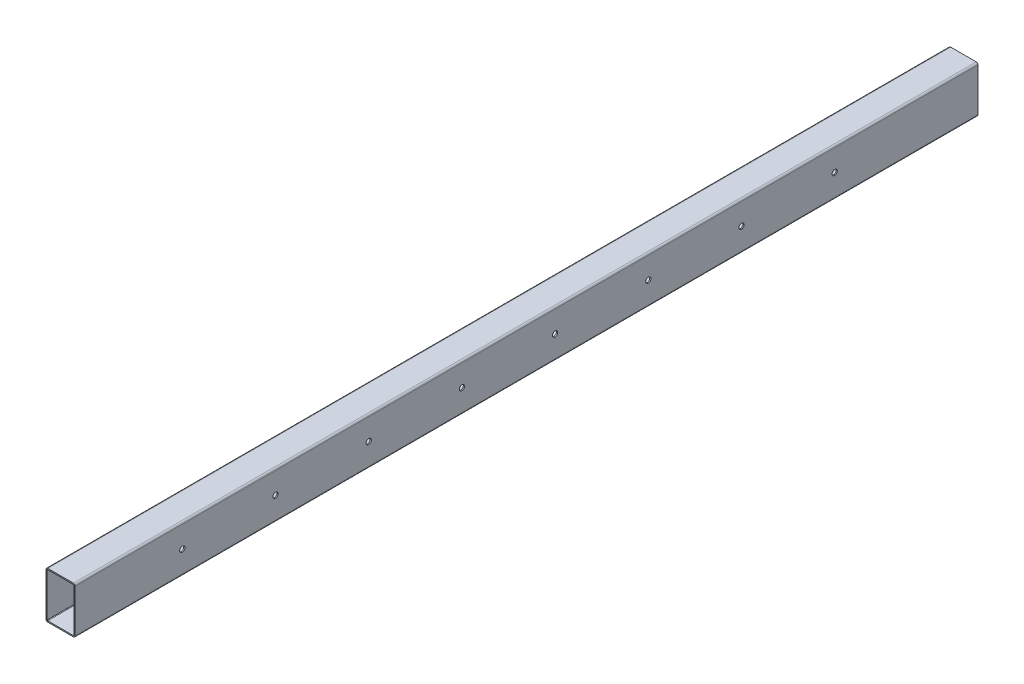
ISO-10303-21;
HEADER;
FILE_DESCRIPTION(('STEP AP214'),'2;1');
FILE_NAME('part.step','',(''),(''),'','','');
FILE_SCHEMA(('AUTOMOTIVE_DESIGN { 1 0 10303 214 1 1 1 1 }'));
ENDSEC;
DATA;
#1=APPLICATION_CONTEXT('core data for automotive mechanical design processes');
#2=APPLICATION_PROTOCOL_DEFINITION('international standard','automotive_design',2000,#1);
#3=PRODUCT_CONTEXT('',#1,'mechanical');
#4=PRODUCT('Part','Part','',(#3));
#5=PRODUCT_RELATED_PRODUCT_CATEGORY('part','',(#4));
#6=PRODUCT_DEFINITION_FORMATION('','',#4);
#7=PRODUCT_DEFINITION_CONTEXT('part definition',#1,'design');
#8=PRODUCT_DEFINITION('design','',#6,#7);
#9=PRODUCT_DEFINITION_SHAPE('','',#8);
#10=(LENGTH_UNIT() NAMED_UNIT(*) SI_UNIT(.MILLI.,.METRE.));
#11=(NAMED_UNIT(*) PLANE_ANGLE_UNIT() SI_UNIT($,.RADIAN.));
#12=(NAMED_UNIT(*) SI_UNIT($,.STERADIAN.) SOLID_ANGLE_UNIT());
#13=UNCERTAINTY_MEASURE_WITH_UNIT(LENGTH_MEASURE(1.E-05),#10,'distance_accuracy_value','');
#14=(GEOMETRIC_REPRESENTATION_CONTEXT(3) GLOBAL_UNCERTAINTY_ASSIGNED_CONTEXT((#13)) GLOBAL_UNIT_ASSIGNED_CONTEXT((#10,
#11,#12)) REPRESENTATION_CONTEXT('',''));
#15=CARTESIAN_POINT('',(0.,0.,0.));
#16=DIRECTION('',(0.,0.,1.));
#17=DIRECTION('',(1.,0.,0.));
#18=AXIS2_PLACEMENT_3D('',#15,#16,#17);
#19=CARTESIAN_POINT('',(3.,77.,-775.));
#20=DIRECTION('',(0.,0.,1.));
#21=DIRECTION('',(1.,0.,0.));
#22=AXIS2_PLACEMENT_3D('',#19,#20,#21);
#23=CYLINDRICAL_SURFACE('',#22,3.00000000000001);
#24=CARTESIAN_POINT('',(3.,77.,775.));
#25=DIRECTION('',(0.,0.,1.));
#26=DIRECTION('',(1.,0.,0.));
#27=AXIS2_PLACEMENT_3D('',#24,#25,#26);
#28=CIRCLE('',#27,3.00000000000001);
#29=CARTESIAN_POINT('',(3.,80.0000000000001,775.));
#30=VERTEX_POINT('',#29);
#31=CARTESIAN_POINT('',(0.,77.,775.));
#32=VERTEX_POINT('',#31);
#33=EDGE_CURVE('E521',#30,#32,#28,.T.);
#34=ORIENTED_EDGE('',*,*,#33,.F.);
#35=DIRECTION('',(0.,0.,1.));
#36=VECTOR('',#35,1.);
#37=CARTESIAN_POINT('',(3.,80.0000000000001,-775.));
#38=LINE('',#37,#36);
#39=CARTESIAN_POINT('',(3.,80.0000000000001,-775.));
#40=VERTEX_POINT('',#39);
#41=EDGE_CURVE('E580',#40,#30,#38,.T.);
#42=ORIENTED_EDGE('',*,*,#41,.F.);
#43=CARTESIAN_POINT('',(3.,77.,-775.));
#44=DIRECTION('',(0.,0.,1.));
#45=DIRECTION('',(1.,0.,0.));
#46=AXIS2_PLACEMENT_3D('',#43,#44,#45);
#47=CIRCLE('',#46,3.00000000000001);
#48=CARTESIAN_POINT('',(0.,77.,-775.));
#49=VERTEX_POINT('',#48);
#50=EDGE_CURVE('E555',#40,#49,#47,.T.);
#51=ORIENTED_EDGE('',*,*,#50,.T.);
#52=DIRECTION('',(0.,0.,1.));
#53=VECTOR('',#52,1.);
#54=CARTESIAN_POINT('',(0.,77.,-775.));
#55=LINE('',#54,#53);
#56=EDGE_CURVE('E579',#49,#32,#55,.T.);
#57=ORIENTED_EDGE('',*,*,#56,.T.);
#58=EDGE_LOOP('',(#34,#42,#51,#57));
#59=FACE_BOUND('',#58,.T.);
#60=ADVANCED_FACE('F348',(#59),#23,.T.);
#61=CARTESIAN_POINT('',(3.,80.0000000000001,-775.));
#62=DIRECTION('',(0.,1.,0.));
#63=DIRECTION('',(-1.,0.,0.));
#64=AXIS2_PLACEMENT_3D('',#61,#62,#63);
#65=PLANE('',#64);
#66=DIRECTION('',(-1.,0.,0.));
#67=VECTOR('',#66,1.);
#68=CARTESIAN_POINT('',(3.,80.0000000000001,775.));
#69=LINE('',#68,#67);
#70=CARTESIAN_POINT('',(47.,80.0000000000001,775.));
#71=VERTEX_POINT('',#70);
#72=EDGE_CURVE('E552',#71,#30,#69,.T.);
#73=ORIENTED_EDGE('',*,*,#72,.F.);
#74=DIRECTION('',(0.,0.,1.));
#75=VECTOR('',#74,1.);
#76=CARTESIAN_POINT('',(47.,80.0000000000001,-775.));
#77=LINE('',#76,#75);
#78=CARTESIAN_POINT('',(47.,80.0000000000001,-775.));
#79=VERTEX_POINT('',#78);
#80=EDGE_CURVE('E583',#79,#71,#77,.T.);
#81=ORIENTED_EDGE('',*,*,#80,.F.);
#82=DIRECTION('',(-1.,0.,0.));
#83=VECTOR('',#82,1.);
#84=CARTESIAN_POINT('',(3.,80.0000000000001,-775.));
#85=LINE('',#84,#83);
#86=EDGE_CURVE('E576',#79,#40,#85,.T.);
#87=ORIENTED_EDGE('',*,*,#86,.T.);
#88=ORIENTED_EDGE('',*,*,#41,.T.);
#89=EDGE_LOOP('',(#73,#81,#87,#88));
#90=FACE_BOUND('',#89,.T.);
#91=ADVANCED_FACE('F692',(#90),#65,.T.);
#92=CARTESIAN_POINT('',(47.,77.,-775.));
#93=DIRECTION('',(0.,0.,1.));
#94=DIRECTION('',(1.,0.,0.));
#95=AXIS2_PLACEMENT_3D('',#92,#93,#94);
#96=CYLINDRICAL_SURFACE('',#95,3.);
#97=CARTESIAN_POINT('',(47.,77.,775.));
#98=DIRECTION('',(0.,0.,1.));
#99=DIRECTION('',(1.,0.,0.));
#100=AXIS2_PLACEMENT_3D('',#97,#98,#99);
#101=CIRCLE('',#100,3.);
#102=CARTESIAN_POINT('',(50.,77.,775.));
#103=VERTEX_POINT('',#102);
#104=EDGE_CURVE('E549',#103,#71,#101,.T.);
#105=ORIENTED_EDGE('',*,*,#104,.F.);
#106=DIRECTION('',(0.,0.,1.));
#107=VECTOR('',#106,1.);
#108=CARTESIAN_POINT('',(50.,77.,-775.));
#109=LINE('',#108,#107);
#110=CARTESIAN_POINT('',(50.,77.,-775.));
#111=VERTEX_POINT('',#110);
#112=EDGE_CURVE('E585',#111,#103,#109,.T.);
#113=ORIENTED_EDGE('',*,*,#112,.F.);
#114=CARTESIAN_POINT('',(47.,77.,-775.));
#115=DIRECTION('',(0.,0.,1.));
#116=DIRECTION('',(1.,0.,0.));
#117=AXIS2_PLACEMENT_3D('',#114,#115,#116);
#118=CIRCLE('',#117,3.);
#119=EDGE_CURVE('E573',#111,#79,#118,.T.);
#120=ORIENTED_EDGE('',*,*,#119,.T.);
#121=ORIENTED_EDGE('',*,*,#80,.T.);
#122=EDGE_LOOP('',(#105,#113,#120,#121));
#123=FACE_BOUND('',#122,.T.);
#124=ADVANCED_FACE('F698',(#123),#96,.T.);
#125=CARTESIAN_POINT('',(50.,2.99999999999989,-775.));
#126=DIRECTION('',(1.,0.,0.));
#127=DIRECTION('',(0.,1.,0.));
#128=AXIS2_PLACEMENT_3D('',#125,#126,#127);
#129=PLANE('',#128);
#130=CARTESIAN_POINT('',(50.,40.,431.));
#131=DIRECTION('',(1.,0.,0.));
#132=DIRECTION('',(0.,1.,0.));
#133=AXIS2_PLACEMENT_3D('',#130,#131,#132);
#134=CIRCLE('',#133,4.50000000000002);
#135=CARTESIAN_POINT('',(50.,44.5000000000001,431.));
#136=VERTEX_POINT('',#135);
#137=EDGE_CURVE('E875',#136,#136,#134,.T.);
#138=ORIENTED_EDGE('',*,*,#137,.F.);
#139=EDGE_LOOP('',(#138));
#140=FACE_BOUND('',#139,.T.);
#141=CARTESIAN_POINT('',(50.,40.,591.));
#142=DIRECTION('',(1.,0.,0.));
#143=DIRECTION('',(0.,1.,0.));
#144=AXIS2_PLACEMENT_3D('',#141,#142,#143);
#145=CIRCLE('',#144,4.50000000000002);
#146=CARTESIAN_POINT('',(50.,44.5000000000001,591.));
#147=VERTEX_POINT('',#146);
#148=EDGE_CURVE('E869',#147,#147,#145,.T.);
#149=ORIENTED_EDGE('',*,*,#148,.F.);
#150=EDGE_LOOP('',(#149));
#151=FACE_BOUND('',#150,.T.);
#152=DIRECTION('',(0.,1.,0.));
#153=VECTOR('',#152,1.);
#154=CARTESIAN_POINT('',(50.,2.99999999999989,775.));
#155=LINE('',#154,#153);
#156=CARTESIAN_POINT('',(50.,2.99999999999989,775.));
#157=VERTEX_POINT('',#156);
#158=EDGE_CURVE('E546',#157,#103,#155,.T.);
#159=ORIENTED_EDGE('',*,*,#158,.F.);
#160=DIRECTION('',(0.,0.,1.));
#161=VECTOR('',#160,1.);
#162=CARTESIAN_POINT('',(50.,2.99999999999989,-775.));
#163=LINE('',#162,#161);
#164=CARTESIAN_POINT('',(50.,2.99999999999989,-775.));
#165=VERTEX_POINT('',#164);
#166=EDGE_CURVE('E587',#165,#157,#163,.T.);
#167=ORIENTED_EDGE('',*,*,#166,.F.);
#168=DIRECTION('',(0.,1.,0.));
#169=VECTOR('',#168,1.);
#170=CARTESIAN_POINT('',(50.,2.99999999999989,-775.));
#171=LINE('',#170,#169);
#172=EDGE_CURVE('E570',#165,#111,#171,.T.);
#173=ORIENTED_EDGE('',*,*,#172,.T.);
#174=ORIENTED_EDGE('',*,*,#112,.T.);
#175=EDGE_LOOP('',(#159,#167,#173,#174));
#176=FACE_BOUND('',#175,.T.);
#177=CARTESIAN_POINT('',(50.,40.,271.));
#178=DIRECTION('',(1.,0.,0.));
#179=DIRECTION('',(0.,1.,0.));
#180=AXIS2_PLACEMENT_3D('',#177,#178,#179);
#181=CIRCLE('',#180,4.50000000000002);
#182=CARTESIAN_POINT('',(50.,44.5000000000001,271.));
#183=VERTEX_POINT('',#182);
#184=EDGE_CURVE('E582',#183,#183,#181,.T.);
#185=ORIENTED_EDGE('',*,*,#184,.F.);
#186=EDGE_LOOP('',(#185));
#187=FACE_BOUND('',#186,.T.);
#188=CARTESIAN_POINT('',(50.,40.,111.));
#189=DIRECTION('',(1.,0.,0.));
#190=DIRECTION('',(0.,1.,0.));
#191=AXIS2_PLACEMENT_3D('',#188,#189,#190);
#192=CIRCLE('',#191,4.50000000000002);
#193=CARTESIAN_POINT('',(50.,44.5000000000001,111.));
#194=VERTEX_POINT('',#193);
#195=EDGE_CURVE('E606',#194,#194,#192,.T.);
#196=ORIENTED_EDGE('',*,*,#195,.F.);
#197=EDGE_LOOP('',(#196));
#198=FACE_BOUND('',#197,.T.);
#199=CARTESIAN_POINT('',(50.,40.,-49.));
#200=DIRECTION('',(1.,0.,0.));
#201=DIRECTION('',(0.,1.,0.));
#202=AXIS2_PLACEMENT_3D('',#199,#200,#201);
#203=CIRCLE('',#202,4.50000000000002);
#204=CARTESIAN_POINT('',(50.,44.5000000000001,-49.));
#205=VERTEX_POINT('',#204);
#206=EDGE_CURVE('E612',#205,#205,#203,.T.);
#207=ORIENTED_EDGE('',*,*,#206,.F.);
#208=EDGE_LOOP('',(#207));
#209=FACE_BOUND('',#208,.T.);
#210=CARTESIAN_POINT('',(50.,40.,-209.));
#211=DIRECTION('',(1.,0.,0.));
#212=DIRECTION('',(0.,1.,0.));
#213=AXIS2_PLACEMENT_3D('',#210,#211,#212);
#214=CIRCLE('',#213,4.50000000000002);
#215=CARTESIAN_POINT('',(50.,44.5000000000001,-209.));
#216=VERTEX_POINT('',#215);
#217=EDGE_CURVE('E618',#216,#216,#214,.T.);
#218=ORIENTED_EDGE('',*,*,#217,.F.);
#219=EDGE_LOOP('',(#218));
#220=FACE_BOUND('',#219,.T.);
#221=CARTESIAN_POINT('',(50.,40.,-369.));
#222=DIRECTION('',(1.,0.,0.));
#223=DIRECTION('',(0.,1.,0.));
#224=AXIS2_PLACEMENT_3D('',#221,#222,#223);
#225=CIRCLE('',#224,4.50000000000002);
#226=CARTESIAN_POINT('',(50.,44.5000000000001,-369.));
#227=VERTEX_POINT('',#226);
#228=EDGE_CURVE('E624',#227,#227,#225,.T.);
#229=ORIENTED_EDGE('',*,*,#228,.F.);
#230=EDGE_LOOP('',(#229));
#231=FACE_BOUND('',#230,.T.);
#232=CARTESIAN_POINT('',(50.,40.,-529.));
#233=DIRECTION('',(1.,0.,0.));
#234=DIRECTION('',(0.,1.,0.));
#235=AXIS2_PLACEMENT_3D('',#232,#233,#234);
#236=CIRCLE('',#235,4.50000000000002);
#237=CARTESIAN_POINT('',(50.,44.5000000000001,-529.));
#238=VERTEX_POINT('',#237);
#239=EDGE_CURVE('E630',#238,#238,#236,.T.);
#240=ORIENTED_EDGE('',*,*,#239,.F.);
#241=EDGE_LOOP('',(#240));
#242=FACE_BOUND('',#241,.T.);
#243=ADVANCED_FACE('F808',(#140,#151,#176,#187,#198,#209,#220,#231,#242),#129,.T.);
#244=CARTESIAN_POINT('',(47.,2.99999999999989,-775.));
#245=DIRECTION('',(0.,0.,1.));
#246=DIRECTION('',(1.,0.,0.));
#247=AXIS2_PLACEMENT_3D('',#244,#245,#246);
#248=CYLINDRICAL_SURFACE('',#247,3.);
#249=CARTESIAN_POINT('',(47.,2.99999999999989,775.));
#250=DIRECTION('',(0.,0.,1.));
#251=DIRECTION('',(-1.,0.,0.));
#252=AXIS2_PLACEMENT_3D('',#249,#250,#251);
#253=CIRCLE('',#252,3.);
#254=CARTESIAN_POINT('',(47.,0.,775.));
#255=VERTEX_POINT('',#254);
#256=EDGE_CURVE('E543',#255,#157,#253,.T.);
#257=ORIENTED_EDGE('',*,*,#256,.F.);
#258=DIRECTION('',(0.,0.,1.));
#259=VECTOR('',#258,1.);
#260=CARTESIAN_POINT('',(47.,0.,-775.));
#261=LINE('',#260,#259);
#262=CARTESIAN_POINT('',(47.,0.,-775.));
#263=VERTEX_POINT('',#262);
#264=EDGE_CURVE('E589',#263,#255,#261,.T.);
#265=ORIENTED_EDGE('',*,*,#264,.F.);
#266=CARTESIAN_POINT('',(47.,2.99999999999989,-775.));
#267=DIRECTION('',(0.,0.,1.));
#268=DIRECTION('',(-1.,0.,0.));
#269=AXIS2_PLACEMENT_3D('',#266,#267,#268);
#270=CIRCLE('',#269,3.);
#271=EDGE_CURVE('E567',#263,#165,#270,.T.);
#272=ORIENTED_EDGE('',*,*,#271,.T.);
#273=ORIENTED_EDGE('',*,*,#166,.T.);
#274=EDGE_LOOP('',(#257,#265,#272,#273));
#275=FACE_BOUND('',#274,.T.);
#276=ADVANCED_FACE('F812',(#275),#248,.T.);
#277=CARTESIAN_POINT('',(3.00000000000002,0.,-775.));
#278=DIRECTION('',(0.,-1.,0.));
#279=DIRECTION('',(0.,0.,-1.));
#280=AXIS2_PLACEMENT_3D('',#277,#278,#279);
#281=PLANE('',#280);
#282=DIRECTION('',(1.,0.,0.));
#283=VECTOR('',#282,1.);
#284=CARTESIAN_POINT('',(3.00000000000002,0.,775.));
#285=LINE('',#284,#283);
#286=CARTESIAN_POINT('',(3.00000000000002,0.,775.));
#287=VERTEX_POINT('',#286);
#288=EDGE_CURVE('E540',#287,#255,#285,.T.);
#289=ORIENTED_EDGE('',*,*,#288,.F.);
#290=DIRECTION('',(0.,0.,1.));
#291=VECTOR('',#290,1.);
#292=CARTESIAN_POINT('',(3.00000000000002,0.,-775.));
#293=LINE('',#292,#291);
#294=CARTESIAN_POINT('',(3.00000000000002,0.,-775.));
#295=VERTEX_POINT('',#294);
#296=EDGE_CURVE('E591',#295,#287,#293,.T.);
#297=ORIENTED_EDGE('',*,*,#296,.F.);
#298=DIRECTION('',(1.,0.,0.));
#299=VECTOR('',#298,1.);
#300=CARTESIAN_POINT('',(3.00000000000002,0.,-775.));
#301=LINE('',#300,#299);
#302=EDGE_CURVE('E564',#295,#263,#301,.T.);
#303=ORIENTED_EDGE('',*,*,#302,.T.);
#304=ORIENTED_EDGE('',*,*,#264,.T.);
#305=EDGE_LOOP('',(#289,#297,#303,#304));
#306=FACE_BOUND('',#305,.T.);
#307=ADVANCED_FACE('F765',(#306),#281,.T.);
#308=CARTESIAN_POINT('',(3.,2.99999999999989,-775.));
#309=DIRECTION('',(0.,0.,1.));
#310=DIRECTION('',(1.,0.,0.));
#311=AXIS2_PLACEMENT_3D('',#308,#309,#310);
#312=CYLINDRICAL_SURFACE('',#311,3.);
#313=CARTESIAN_POINT('',(3.,2.99999999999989,775.));
#314=DIRECTION('',(0.,0.,1.));
#315=DIRECTION('',(1.,0.,0.));
#316=AXIS2_PLACEMENT_3D('',#313,#314,#315);
#317=CIRCLE('',#316,3.);
#318=CARTESIAN_POINT('',(0.,3.00000000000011,775.));
#319=VERTEX_POINT('',#318);
#320=EDGE_CURVE('E537',#319,#287,#317,.T.);
#321=ORIENTED_EDGE('',*,*,#320,.F.);
#322=DIRECTION('',(0.,0.,1.));
#323=VECTOR('',#322,1.);
#324=CARTESIAN_POINT('',(0.,3.00000000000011,-775.));
#325=LINE('',#324,#323);
#326=CARTESIAN_POINT('',(0.,3.00000000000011,-775.));
#327=VERTEX_POINT('',#326);
#328=EDGE_CURVE('E593',#327,#319,#325,.T.);
#329=ORIENTED_EDGE('',*,*,#328,.F.);
#330=CARTESIAN_POINT('',(3.,2.99999999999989,-775.));
#331=DIRECTION('',(0.,0.,1.));
#332=DIRECTION('',(1.,0.,0.));
#333=AXIS2_PLACEMENT_3D('',#330,#331,#332);
#334=CIRCLE('',#333,3.);
#335=EDGE_CURVE('E561',#327,#295,#334,.T.);
#336=ORIENTED_EDGE('',*,*,#335,.T.);
#337=ORIENTED_EDGE('',*,*,#296,.T.);
#338=EDGE_LOOP('',(#321,#329,#336,#337));
#339=FACE_BOUND('',#338,.T.);
#340=ADVANCED_FACE('F757',(#339),#312,.T.);
#341=CARTESIAN_POINT('',(0.,3.00000000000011,-775.));
#342=DIRECTION('',(-1.,0.,0.));
#343=DIRECTION('',(0.,-1.,0.));
#344=AXIS2_PLACEMENT_3D('',#341,#342,#343);
#345=PLANE('',#344);
#346=CARTESIAN_POINT('',(0.,40.,431.));
#347=DIRECTION('',(1.,0.,0.));
#348=DIRECTION('',(0.,1.,0.));
#349=AXIS2_PLACEMENT_3D('',#346,#347,#348);
#350=CIRCLE('',#349,4.50000000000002);
#351=CARTESIAN_POINT('',(0.,44.5000000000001,431.));
#352=VERTEX_POINT('',#351);
#353=EDGE_CURVE('E770',#352,#352,#350,.T.);
#354=ORIENTED_EDGE('',*,*,#353,.T.);
#355=EDGE_LOOP('',(#354));
#356=FACE_BOUND('',#355,.T.);
#357=CARTESIAN_POINT('',(0.,40.,591.));
#358=DIRECTION('',(1.,0.,0.));
#359=DIRECTION('',(0.,1.,0.));
#360=AXIS2_PLACEMENT_3D('',#357,#358,#359);
#361=CIRCLE('',#360,4.50000000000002);
#362=CARTESIAN_POINT('',(0.,44.5000000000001,591.));
#363=VERTEX_POINT('',#362);
#364=EDGE_CURVE('E600',#363,#363,#361,.T.);
#365=ORIENTED_EDGE('',*,*,#364,.T.);
#366=EDGE_LOOP('',(#365));
#367=FACE_BOUND('',#366,.T.);
#368=DIRECTION('',(0.,-1.,0.));
#369=VECTOR('',#368,1.);
#370=CARTESIAN_POINT('',(0.,3.00000000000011,775.));
#371=LINE('',#370,#369);
#372=EDGE_CURVE('E534',#32,#319,#371,.T.);
#373=ORIENTED_EDGE('',*,*,#372,.F.);
#374=ORIENTED_EDGE('',*,*,#56,.F.);
#375=DIRECTION('',(0.,-1.,0.));
#376=VECTOR('',#375,1.);
#377=CARTESIAN_POINT('',(0.,3.00000000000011,-775.));
#378=LINE('',#377,#376);
#379=EDGE_CURVE('E558',#49,#327,#378,.T.);
#380=ORIENTED_EDGE('',*,*,#379,.T.);
#381=ORIENTED_EDGE('',*,*,#328,.T.);
#382=EDGE_LOOP('',(#373,#374,#380,#381));
#383=FACE_BOUND('',#382,.T.);
#384=CARTESIAN_POINT('',(0.,40.,271.));
#385=DIRECTION('',(1.,0.,0.));
#386=DIRECTION('',(0.,1.,0.));
#387=AXIS2_PLACEMENT_3D('',#384,#385,#386);
#388=CIRCLE('',#387,4.50000000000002);
#389=CARTESIAN_POINT('',(0.,44.5000000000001,271.));
#390=VERTEX_POINT('',#389);
#391=EDGE_CURVE('E636',#390,#390,#388,.T.);
#392=ORIENTED_EDGE('',*,*,#391,.T.);
#393=EDGE_LOOP('',(#392));
#394=FACE_BOUND('',#393,.T.);
#395=CARTESIAN_POINT('',(0.,40.,111.));
#396=DIRECTION('',(1.,0.,0.));
#397=DIRECTION('',(0.,1.,0.));
#398=AXIS2_PLACEMENT_3D('',#395,#396,#397);
#399=CIRCLE('',#398,4.50000000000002);
#400=CARTESIAN_POINT('',(0.,44.5000000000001,111.));
#401=VERTEX_POINT('',#400);
#402=EDGE_CURVE('E642',#401,#401,#399,.T.);
#403=ORIENTED_EDGE('',*,*,#402,.T.);
#404=EDGE_LOOP('',(#403));
#405=FACE_BOUND('',#404,.T.);
#406=CARTESIAN_POINT('',(0.,40.,-49.));
#407=DIRECTION('',(1.,0.,0.));
#408=DIRECTION('',(0.,1.,0.));
#409=AXIS2_PLACEMENT_3D('',#406,#407,#408);
#410=CIRCLE('',#409,4.50000000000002);
#411=CARTESIAN_POINT('',(0.,44.5000000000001,-49.));
#412=VERTEX_POINT('',#411);
#413=EDGE_CURVE('E648',#412,#412,#410,.T.);
#414=ORIENTED_EDGE('',*,*,#413,.T.);
#415=EDGE_LOOP('',(#414));
#416=FACE_BOUND('',#415,.T.);
#417=CARTESIAN_POINT('',(0.,40.,-209.));
#418=DIRECTION('',(1.,0.,0.));
#419=DIRECTION('',(0.,1.,0.));
#420=AXIS2_PLACEMENT_3D('',#417,#418,#419);
#421=CIRCLE('',#420,4.50000000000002);
#422=CARTESIAN_POINT('',(0.,44.5000000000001,-209.));
#423=VERTEX_POINT('',#422);
#424=EDGE_CURVE('E654',#423,#423,#421,.T.);
#425=ORIENTED_EDGE('',*,*,#424,.T.);
#426=EDGE_LOOP('',(#425));
#427=FACE_BOUND('',#426,.T.);
#428=CARTESIAN_POINT('',(0.,40.,-369.));
#429=DIRECTION('',(1.,0.,0.));
#430=DIRECTION('',(0.,1.,0.));
#431=AXIS2_PLACEMENT_3D('',#428,#429,#430);
#432=CIRCLE('',#431,4.50000000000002);
#433=CARTESIAN_POINT('',(0.,44.5000000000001,-369.));
#434=VERTEX_POINT('',#433);
#435=EDGE_CURVE('E660',#434,#434,#432,.T.);
#436=ORIENTED_EDGE('',*,*,#435,.T.);
#437=EDGE_LOOP('',(#436));
#438=FACE_BOUND('',#437,.T.);
#439=CARTESIAN_POINT('',(0.,40.,-529.));
#440=DIRECTION('',(1.,0.,0.));
#441=DIRECTION('',(0.,1.,0.));
#442=AXIS2_PLACEMENT_3D('',#439,#440,#441);
#443=CIRCLE('',#442,4.50000000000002);
#444=CARTESIAN_POINT('',(0.,44.5000000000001,-529.));
#445=VERTEX_POINT('',#444);
#446=EDGE_CURVE('E356',#445,#445,#443,.T.);
#447=ORIENTED_EDGE('',*,*,#446,.T.);
#448=EDGE_LOOP('',(#447));
#449=FACE_BOUND('',#448,.T.);
#450=ADVANCED_FACE('F668',(#356,#367,#383,#394,#405,#416,#427,#438,#449),#345,.T.);
#451=CARTESIAN_POINT('',(3.,77.,-775.));
#452=DIRECTION('',(0.,0.,1.));
#453=DIRECTION('',(1.,0.,0.));
#454=AXIS2_PLACEMENT_3D('',#451,#452,#453);
#455=PLANE('',#454);
#456=DIRECTION('',(-1.,0.,0.));
#457=VECTOR('',#456,1.);
#458=CARTESIAN_POINT('',(3.,78.0000000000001,-775.));
#459=LINE('',#458,#457);
#460=CARTESIAN_POINT('',(47.,78.0000000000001,-775.));
#461=VERTEX_POINT('',#460);
#462=CARTESIAN_POINT('',(3.,78.0000000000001,-775.));
#463=VERTEX_POINT('',#462);
#464=EDGE_CURVE('E516',#461,#463,#459,.T.);
#465=ORIENTED_EDGE('',*,*,#464,.T.);
#466=CARTESIAN_POINT('',(3.,77.,-775.));
#467=DIRECTION('',(0.,0.,1.));
#468=DIRECTION('',(-1.,0.,0.));
#469=AXIS2_PLACEMENT_3D('',#466,#467,#468);
#470=CIRCLE('',#469,0.999999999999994);
#471=CARTESIAN_POINT('',(2.,77.,-775.));
#472=VERTEX_POINT('',#471);
#473=EDGE_CURVE('E498',#463,#472,#470,.T.);
#474=ORIENTED_EDGE('',*,*,#473,.T.);
#475=DIRECTION('',(0.,-1.,0.));
#476=VECTOR('',#475,1.);
#477=CARTESIAN_POINT('',(2.,77.,-775.));
#478=LINE('',#477,#476);
#479=CARTESIAN_POINT('',(2.00000000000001,3.00000000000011,-775.));
#480=VERTEX_POINT('',#479);
#481=EDGE_CURVE('E501',#472,#480,#478,.T.);
#482=ORIENTED_EDGE('',*,*,#481,.T.);
#483=CARTESIAN_POINT('',(3.00000000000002,2.99999999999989,-775.));
#484=DIRECTION('',(0.,0.,1.));
#485=DIRECTION('',(-1.,0.,0.));
#486=AXIS2_PLACEMENT_3D('',#483,#484,#485);
#487=CIRCLE('',#486,1.);
#488=CARTESIAN_POINT('',(3.00000000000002,2.,-775.));
#489=VERTEX_POINT('',#488);
#490=EDGE_CURVE('E363',#480,#489,#487,.T.);
#491=ORIENTED_EDGE('',*,*,#490,.T.);
#492=DIRECTION('',(1.,0.,0.));
#493=VECTOR('',#492,1.);
#494=CARTESIAN_POINT('',(3.00000000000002,2.,-775.));
#495=LINE('',#494,#493);
#496=CARTESIAN_POINT('',(47.,2.,-775.));
#497=VERTEX_POINT('',#496);
#498=EDGE_CURVE('E504',#489,#497,#495,.T.);
#499=ORIENTED_EDGE('',*,*,#498,.T.);
#500=CARTESIAN_POINT('',(47.,2.99999999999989,-775.));
#501=DIRECTION('',(0.,0.,1.));
#502=DIRECTION('',(-1.,0.,0.));
#503=AXIS2_PLACEMENT_3D('',#500,#501,#502);
#504=CIRCLE('',#503,1.00000000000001);
#505=CARTESIAN_POINT('',(48.,3.00000000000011,-775.));
#506=VERTEX_POINT('',#505);
#507=EDGE_CURVE('E507',#497,#506,#504,.T.);
#508=ORIENTED_EDGE('',*,*,#507,.T.);
#509=DIRECTION('',(0.,1.,0.));
#510=VECTOR('',#509,1.);
#511=CARTESIAN_POINT('',(48.,77.,-775.));
#512=LINE('',#511,#510);
#513=CARTESIAN_POINT('',(48.,77.,-775.));
#514=VERTEX_POINT('',#513);
#515=EDGE_CURVE('E510',#506,#514,#512,.T.);
#516=ORIENTED_EDGE('',*,*,#515,.T.);
#517=CARTESIAN_POINT('',(47.,77.,-775.));
#518=DIRECTION('',(0.,0.,1.));
#519=DIRECTION('',(1.,0.,0.));
#520=AXIS2_PLACEMENT_3D('',#517,#518,#519);
#521=CIRCLE('',#520,1.00000000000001);
#522=EDGE_CURVE('E513',#514,#461,#521,.T.);
#523=ORIENTED_EDGE('',*,*,#522,.T.);
#524=EDGE_LOOP('',(#465,#474,#482,#491,#499,#508,#516,#523));
#525=FACE_BOUND('',#524,.T.);
#526=ORIENTED_EDGE('',*,*,#50,.F.);
#527=ORIENTED_EDGE('',*,*,#86,.F.);
#528=ORIENTED_EDGE('',*,*,#119,.F.);
#529=ORIENTED_EDGE('',*,*,#172,.F.);
#530=ORIENTED_EDGE('',*,*,#271,.F.);
#531=ORIENTED_EDGE('',*,*,#302,.F.);
#532=ORIENTED_EDGE('',*,*,#335,.F.);
#533=ORIENTED_EDGE('',*,*,#379,.F.);
#534=EDGE_LOOP('',(#526,#527,#528,#529,#530,#531,#532,#533));
#535=FACE_BOUND('',#534,.T.);
#536=ADVANCED_FACE('F756',(#525,#535),#455,.F.);
#537=CARTESIAN_POINT('',(3.,77.,775.));
#538=DIRECTION('',(0.,0.,1.));
#539=DIRECTION('',(1.,0.,0.));
#540=AXIS2_PLACEMENT_3D('',#537,#538,#539);
#541=PLANE('',#540);
#542=CARTESIAN_POINT('',(3.,77.,775.));
#543=DIRECTION('',(0.,0.,1.));
#544=DIRECTION('',(-1.,0.,0.));
#545=AXIS2_PLACEMENT_3D('',#542,#543,#544);
#546=CIRCLE('',#545,0.999999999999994);
#547=CARTESIAN_POINT('',(3.,78.0000000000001,775.));
#548=VERTEX_POINT('',#547);
#549=CARTESIAN_POINT('',(2.,77.,775.));
#550=VERTEX_POINT('',#549);
#551=EDGE_CURVE('E371',#548,#550,#546,.T.);
#552=ORIENTED_EDGE('',*,*,#551,.F.);
#553=DIRECTION('',(-1.,0.,0.));
#554=VECTOR('',#553,1.);
#555=CARTESIAN_POINT('',(3.,78.0000000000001,775.));
#556=LINE('',#555,#554);
#557=CARTESIAN_POINT('',(47.,78.0000000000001,775.));
#558=VERTEX_POINT('',#557);
#559=EDGE_CURVE('E495',#558,#548,#556,.T.);
#560=ORIENTED_EDGE('',*,*,#559,.F.);
#561=CARTESIAN_POINT('',(47.,77.,775.));
#562=DIRECTION('',(0.,0.,1.));
#563=DIRECTION('',(1.,0.,0.));
#564=AXIS2_PLACEMENT_3D('',#561,#562,#563);
#565=CIRCLE('',#564,1.00000000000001);
#566=CARTESIAN_POINT('',(48.,77.,775.));
#567=VERTEX_POINT('',#566);
#568=EDGE_CURVE('E492',#567,#558,#565,.T.);
#569=ORIENTED_EDGE('',*,*,#568,.F.);
#570=DIRECTION('',(0.,1.,0.));
#571=VECTOR('',#570,1.);
#572=CARTESIAN_POINT('',(48.,77.,775.));
#573=LINE('',#572,#571);
#574=CARTESIAN_POINT('',(48.,3.00000000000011,775.));
#575=VERTEX_POINT('',#574);
#576=EDGE_CURVE('E489',#575,#567,#573,.T.);
#577=ORIENTED_EDGE('',*,*,#576,.F.);
#578=CARTESIAN_POINT('',(47.,2.99999999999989,775.));
#579=DIRECTION('',(0.,0.,1.));
#580=DIRECTION('',(-1.,0.,0.));
#581=AXIS2_PLACEMENT_3D('',#578,#579,#580);
#582=CIRCLE('',#581,1.00000000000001);
#583=CARTESIAN_POINT('',(47.,2.,775.));
#584=VERTEX_POINT('',#583);
#585=EDGE_CURVE('E483',#584,#575,#582,.T.);
#586=ORIENTED_EDGE('',*,*,#585,.F.);
#587=DIRECTION('',(1.,0.,0.));
#588=VECTOR('',#587,1.);
#589=CARTESIAN_POINT('',(3.00000000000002,2.,775.));
#590=LINE('',#589,#588);
#591=CARTESIAN_POINT('',(3.00000000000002,2.,775.));
#592=VERTEX_POINT('',#591);
#593=EDGE_CURVE('E481',#592,#584,#590,.T.);
#594=ORIENTED_EDGE('',*,*,#593,.F.);
#595=CARTESIAN_POINT('',(3.00000000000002,2.99999999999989,775.));
#596=DIRECTION('',(0.,0.,1.));
#597=DIRECTION('',(-1.,0.,0.));
#598=AXIS2_PLACEMENT_3D('',#595,#596,#597);
#599=CIRCLE('',#598,1.);
#600=CARTESIAN_POINT('',(2.00000000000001,2.99999999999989,775.));
#601=VERTEX_POINT('',#600);
#602=EDGE_CURVE('E463',#601,#592,#599,.T.);
#603=ORIENTED_EDGE('',*,*,#602,.F.);
#604=DIRECTION('',(0.,-1.,0.));
#605=VECTOR('',#604,1.);
#606=CARTESIAN_POINT('',(2.,77.,775.));
#607=LINE('',#606,#605);
#608=EDGE_CURVE('E472',#550,#601,#607,.T.);
#609=ORIENTED_EDGE('',*,*,#608,.F.);
#610=EDGE_LOOP('',(#552,#560,#569,#577,#586,#594,#603,#609));
#611=FACE_BOUND('',#610,.T.);
#612=ORIENTED_EDGE('',*,*,#33,.T.);
#613=ORIENTED_EDGE('',*,*,#372,.T.);
#614=ORIENTED_EDGE('',*,*,#320,.T.);
#615=ORIENTED_EDGE('',*,*,#288,.T.);
#616=ORIENTED_EDGE('',*,*,#256,.T.);
#617=ORIENTED_EDGE('',*,*,#158,.T.);
#618=ORIENTED_EDGE('',*,*,#104,.T.);
#619=ORIENTED_EDGE('',*,*,#72,.T.);
#620=EDGE_LOOP('',(#612,#613,#614,#615,#616,#617,#618,#619));
#621=FACE_BOUND('',#620,.T.);
#622=ADVANCED_FACE('F477',(#611,#621),#541,.T.);
#623=CARTESIAN_POINT('',(3.,77.,-775.));
#624=DIRECTION('',(0.,0.,1.));
#625=DIRECTION('',(1.,0.,0.));
#626=AXIS2_PLACEMENT_3D('',#623,#624,#625);
#627=CYLINDRICAL_SURFACE('',#626,0.999999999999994);
#628=ORIENTED_EDGE('',*,*,#551,.T.);
#629=DIRECTION('',(0.,0.,1.));
#630=VECTOR('',#629,1.);
#631=CARTESIAN_POINT('',(2.,77.,-775.));
#632=LINE('',#631,#630);
#633=EDGE_CURVE('E469',#472,#550,#632,.T.);
#634=ORIENTED_EDGE('',*,*,#633,.F.);
#635=ORIENTED_EDGE('',*,*,#473,.F.);
#636=DIRECTION('',(0.,0.,1.));
#637=VECTOR('',#636,1.);
#638=CARTESIAN_POINT('',(3.,78.0000000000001,-775.));
#639=LINE('',#638,#637);
#640=EDGE_CURVE('E519',#463,#548,#639,.T.);
#641=ORIENTED_EDGE('',*,*,#640,.T.);
#642=EDGE_LOOP('',(#628,#634,#635,#641));
#643=FACE_BOUND('',#642,.T.);
#644=ADVANCED_FACE('F829',(#643),#627,.F.);
#645=CARTESIAN_POINT('',(3.,78.0000000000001,-775.));
#646=DIRECTION('',(0.,1.,0.));
#647=DIRECTION('',(-1.,0.,0.));
#648=AXIS2_PLACEMENT_3D('',#645,#646,#647);
#649=PLANE('',#648);
#650=ORIENTED_EDGE('',*,*,#559,.T.);
#651=ORIENTED_EDGE('',*,*,#640,.F.);
#652=ORIENTED_EDGE('',*,*,#464,.F.);
#653=DIRECTION('',(0.,0.,1.));
#654=VECTOR('',#653,1.);
#655=CARTESIAN_POINT('',(47.,78.0000000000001,-775.));
#656=LINE('',#655,#654);
#657=EDGE_CURVE('E522',#461,#558,#656,.T.);
#658=ORIENTED_EDGE('',*,*,#657,.T.);
#659=EDGE_LOOP('',(#650,#651,#652,#658));
#660=FACE_BOUND('',#659,.T.);
#661=ADVANCED_FACE('F831',(#660),#649,.F.);
#662=CARTESIAN_POINT('',(47.,77.,-775.));
#663=DIRECTION('',(0.,0.,1.));
#664=DIRECTION('',(1.,0.,0.));
#665=AXIS2_PLACEMENT_3D('',#662,#663,#664);
#666=CYLINDRICAL_SURFACE('',#665,1.00000000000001);
#667=ORIENTED_EDGE('',*,*,#568,.T.);
#668=ORIENTED_EDGE('',*,*,#657,.F.);
#669=ORIENTED_EDGE('',*,*,#522,.F.);
#670=DIRECTION('',(0.,0.,1.));
#671=VECTOR('',#670,1.);
#672=CARTESIAN_POINT('',(48.,77.,-775.));
#673=LINE('',#672,#671);
#674=EDGE_CURVE('E524',#514,#567,#673,.T.);
#675=ORIENTED_EDGE('',*,*,#674,.T.);
#676=EDGE_LOOP('',(#667,#668,#669,#675));
#677=FACE_BOUND('',#676,.T.);
#678=ADVANCED_FACE('F835',(#677),#666,.F.);
#679=CARTESIAN_POINT('',(48.,77.,-775.));
#680=DIRECTION('',(1.,0.,0.));
#681=DIRECTION('',(0.,1.,0.));
#682=AXIS2_PLACEMENT_3D('',#679,#680,#681);
#683=PLANE('',#682);
#684=CARTESIAN_POINT('',(48.,40.,431.));
#685=DIRECTION('',(1.,0.,0.));
#686=DIRECTION('',(0.,1.,0.));
#687=AXIS2_PLACEMENT_3D('',#684,#685,#686);
#688=CIRCLE('',#687,4.50000000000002);
#689=CARTESIAN_POINT('',(48.,44.5000000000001,431.));
#690=VERTEX_POINT('',#689);
#691=EDGE_CURVE('E872',#690,#690,#688,.T.);
#692=ORIENTED_EDGE('',*,*,#691,.T.);
#693=EDGE_LOOP('',(#692));
#694=FACE_BOUND('',#693,.T.);
#695=CARTESIAN_POINT('',(48.,40.,591.));
#696=DIRECTION('',(1.,0.,0.));
#697=DIRECTION('',(0.,1.,0.));
#698=AXIS2_PLACEMENT_3D('',#695,#696,#697);
#699=CIRCLE('',#698,4.50000000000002);
#700=CARTESIAN_POINT('',(48.,44.5000000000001,591.));
#701=VERTEX_POINT('',#700);
#702=EDGE_CURVE('E599',#701,#701,#699,.T.);
#703=ORIENTED_EDGE('',*,*,#702,.T.);
#704=EDGE_LOOP('',(#703));
#705=FACE_BOUND('',#704,.T.);
#706=ORIENTED_EDGE('',*,*,#576,.T.);
#707=ORIENTED_EDGE('',*,*,#674,.F.);
#708=ORIENTED_EDGE('',*,*,#515,.F.);
#709=DIRECTION('',(0.,0.,1.));
#710=VECTOR('',#709,1.);
#711=CARTESIAN_POINT('',(48.,3.00000000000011,-775.));
#712=LINE('',#711,#710);
#713=EDGE_CURVE('E526',#506,#575,#712,.T.);
#714=ORIENTED_EDGE('',*,*,#713,.T.);
#715=EDGE_LOOP('',(#706,#707,#708,#714));
#716=FACE_BOUND('',#715,.T.);
#717=CARTESIAN_POINT('',(48.,40.,271.));
#718=DIRECTION('',(1.,0.,0.));
#719=DIRECTION('',(0.,1.,0.));
#720=AXIS2_PLACEMENT_3D('',#717,#718,#719);
#721=CIRCLE('',#720,4.50000000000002);
#722=CARTESIAN_POINT('',(48.,44.5000000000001,271.));
#723=VERTEX_POINT('',#722);
#724=EDGE_CURVE('E603',#723,#723,#721,.T.);
#725=ORIENTED_EDGE('',*,*,#724,.T.);
#726=EDGE_LOOP('',(#725));
#727=FACE_BOUND('',#726,.T.);
#728=CARTESIAN_POINT('',(48.,40.,111.));
#729=DIRECTION('',(1.,0.,0.));
#730=DIRECTION('',(0.,1.,0.));
#731=AXIS2_PLACEMENT_3D('',#728,#729,#730);
#732=CIRCLE('',#731,4.50000000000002);
#733=CARTESIAN_POINT('',(48.,44.5000000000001,111.));
#734=VERTEX_POINT('',#733);
#735=EDGE_CURVE('E609',#734,#734,#732,.T.);
#736=ORIENTED_EDGE('',*,*,#735,.T.);
#737=EDGE_LOOP('',(#736));
#738=FACE_BOUND('',#737,.T.);
#739=CARTESIAN_POINT('',(48.,40.,-49.));
#740=DIRECTION('',(1.,0.,0.));
#741=DIRECTION('',(0.,1.,0.));
#742=AXIS2_PLACEMENT_3D('',#739,#740,#741);
#743=CIRCLE('',#742,4.50000000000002);
#744=CARTESIAN_POINT('',(48.,44.5000000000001,-49.));
#745=VERTEX_POINT('',#744);
#746=EDGE_CURVE('E615',#745,#745,#743,.T.);
#747=ORIENTED_EDGE('',*,*,#746,.T.);
#748=EDGE_LOOP('',(#747));
#749=FACE_BOUND('',#748,.T.);
#750=CARTESIAN_POINT('',(48.,40.,-209.));
#751=DIRECTION('',(1.,0.,0.));
#752=DIRECTION('',(0.,1.,0.));
#753=AXIS2_PLACEMENT_3D('',#750,#751,#752);
#754=CIRCLE('',#753,4.50000000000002);
#755=CARTESIAN_POINT('',(48.,44.5000000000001,-209.));
#756=VERTEX_POINT('',#755);
#757=EDGE_CURVE('E621',#756,#756,#754,.T.);
#758=ORIENTED_EDGE('',*,*,#757,.T.);
#759=EDGE_LOOP('',(#758));
#760=FACE_BOUND('',#759,.T.);
#761=CARTESIAN_POINT('',(48.,40.,-369.));
#762=DIRECTION('',(1.,0.,0.));
#763=DIRECTION('',(0.,1.,0.));
#764=AXIS2_PLACEMENT_3D('',#761,#762,#763);
#765=CIRCLE('',#764,4.50000000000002);
#766=CARTESIAN_POINT('',(48.,44.5000000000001,-369.));
#767=VERTEX_POINT('',#766);
#768=EDGE_CURVE('E627',#767,#767,#765,.T.);
#769=ORIENTED_EDGE('',*,*,#768,.T.);
#770=EDGE_LOOP('',(#769));
#771=FACE_BOUND('',#770,.T.);
#772=CARTESIAN_POINT('',(48.,40.,-529.));
#773=DIRECTION('',(1.,0.,0.));
#774=DIRECTION('',(0.,1.,0.));
#775=AXIS2_PLACEMENT_3D('',#772,#773,#774);
#776=CIRCLE('',#775,4.50000000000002);
#777=CARTESIAN_POINT('',(48.,44.5000000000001,-529.));
#778=VERTEX_POINT('',#777);
#779=EDGE_CURVE('E633',#778,#778,#776,.T.);
#780=ORIENTED_EDGE('',*,*,#779,.T.);
#781=EDGE_LOOP('',(#780));
#782=FACE_BOUND('',#781,.T.);
#783=ADVANCED_FACE('F841',(#694,#705,#716,#727,#738,#749,#760,#771,#782),#683,.F.);
#784=CARTESIAN_POINT('',(47.,2.99999999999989,-775.));
#785=DIRECTION('',(0.,0.,1.));
#786=DIRECTION('',(1.,0.,0.));
#787=AXIS2_PLACEMENT_3D('',#784,#785,#786);
#788=CYLINDRICAL_SURFACE('',#787,1.00000000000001);
#789=ORIENTED_EDGE('',*,*,#585,.T.);
#790=ORIENTED_EDGE('',*,*,#713,.F.);
#791=ORIENTED_EDGE('',*,*,#507,.F.);
#792=DIRECTION('',(0.,0.,1.));
#793=VECTOR('',#792,1.);
#794=CARTESIAN_POINT('',(47.,2.,-775.));
#795=LINE('',#794,#793);
#796=EDGE_CURVE('E528',#497,#584,#795,.T.);
#797=ORIENTED_EDGE('',*,*,#796,.T.);
#798=EDGE_LOOP('',(#789,#790,#791,#797));
#799=FACE_BOUND('',#798,.T.);
#800=ADVANCED_FACE('F848',(#799),#788,.F.);
#801=CARTESIAN_POINT('',(3.00000000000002,2.,-775.));
#802=DIRECTION('',(0.,-1.,0.));
#803=DIRECTION('',(0.,0.,-1.));
#804=AXIS2_PLACEMENT_3D('',#801,#802,#803);
#805=PLANE('',#804);
#806=ORIENTED_EDGE('',*,*,#593,.T.);
#807=ORIENTED_EDGE('',*,*,#796,.F.);
#808=ORIENTED_EDGE('',*,*,#498,.F.);
#809=DIRECTION('',(0.,0.,1.));
#810=VECTOR('',#809,1.);
#811=CARTESIAN_POINT('',(3.00000000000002,2.,-775.));
#812=LINE('',#811,#810);
#813=EDGE_CURVE('E468',#489,#592,#812,.T.);
#814=ORIENTED_EDGE('',*,*,#813,.T.);
#815=EDGE_LOOP('',(#806,#807,#808,#814));
#816=FACE_BOUND('',#815,.T.);
#817=ADVANCED_FACE('F686',(#816),#805,.F.);
#818=CARTESIAN_POINT('',(3.00000000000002,2.99999999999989,-775.));
#819=DIRECTION('',(0.,0.,1.));
#820=DIRECTION('',(1.,0.,0.));
#821=AXIS2_PLACEMENT_3D('',#818,#819,#820);
#822=CYLINDRICAL_SURFACE('',#821,1.);
#823=ORIENTED_EDGE('',*,*,#602,.T.);
#824=ORIENTED_EDGE('',*,*,#813,.F.);
#825=ORIENTED_EDGE('',*,*,#490,.F.);
#826=DIRECTION('',(0.,0.,1.));
#827=VECTOR('',#826,1.);
#828=CARTESIAN_POINT('',(2.00000000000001,2.99999999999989,-775.));
#829=LINE('',#828,#827);
#830=EDGE_CURVE('E459',#480,#601,#829,.T.);
#831=ORIENTED_EDGE('',*,*,#830,.T.);
#832=EDGE_LOOP('',(#823,#824,#825,#831));
#833=FACE_BOUND('',#832,.T.);
#834=ADVANCED_FACE('F461',(#833),#822,.F.);
#835=CARTESIAN_POINT('',(2.,77.,-775.));
#836=DIRECTION('',(-1.,0.,0.));
#837=DIRECTION('',(0.,-1.,0.));
#838=AXIS2_PLACEMENT_3D('',#835,#836,#837);
#839=PLANE('',#838);
#840=CARTESIAN_POINT('',(2.00000000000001,40.,431.));
#841=DIRECTION('',(-1.,0.,0.));
#842=DIRECTION('',(0.,-1.,0.));
#843=AXIS2_PLACEMENT_3D('',#840,#841,#842);
#844=CIRCLE('',#843,4.50000000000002);
#845=CARTESIAN_POINT('',(2.00000000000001,35.5,431.));
#846=VERTEX_POINT('',#845);
#847=EDGE_CURVE('E878',#846,#846,#844,.T.);
#848=ORIENTED_EDGE('',*,*,#847,.T.);
#849=EDGE_LOOP('',(#848));
#850=FACE_BOUND('',#849,.T.);
#851=CARTESIAN_POINT('',(2.00000000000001,40.,591.));
#852=DIRECTION('',(-1.,0.,0.));
#853=DIRECTION('',(0.,-1.,0.));
#854=AXIS2_PLACEMENT_3D('',#851,#852,#853);
#855=CIRCLE('',#854,4.50000000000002);
#856=CARTESIAN_POINT('',(2.00000000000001,35.5,591.));
#857=VERTEX_POINT('',#856);
#858=EDGE_CURVE('E596',#857,#857,#855,.T.);
#859=ORIENTED_EDGE('',*,*,#858,.T.);
#860=EDGE_LOOP('',(#859));
#861=FACE_BOUND('',#860,.T.);
#862=ORIENTED_EDGE('',*,*,#608,.T.);
#863=ORIENTED_EDGE('',*,*,#830,.F.);
#864=ORIENTED_EDGE('',*,*,#481,.F.);
#865=ORIENTED_EDGE('',*,*,#633,.T.);
#866=EDGE_LOOP('',(#862,#863,#864,#865));
#867=FACE_BOUND('',#866,.T.);
#868=CARTESIAN_POINT('',(2.00000000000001,40.,271.));
#869=DIRECTION('',(-1.,0.,0.));
#870=DIRECTION('',(0.,-1.,0.));
#871=AXIS2_PLACEMENT_3D('',#868,#869,#870);
#872=CIRCLE('',#871,4.50000000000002);
#873=CARTESIAN_POINT('',(2.00000000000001,35.5,271.));
#874=VERTEX_POINT('',#873);
#875=EDGE_CURVE('E639',#874,#874,#872,.T.);
#876=ORIENTED_EDGE('',*,*,#875,.T.);
#877=EDGE_LOOP('',(#876));
#878=FACE_BOUND('',#877,.T.);
#879=CARTESIAN_POINT('',(2.00000000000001,40.,111.));
#880=DIRECTION('',(-1.,0.,0.));
#881=DIRECTION('',(0.,-1.,0.));
#882=AXIS2_PLACEMENT_3D('',#879,#880,#881);
#883=CIRCLE('',#882,4.50000000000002);
#884=CARTESIAN_POINT('',(2.00000000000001,35.5,111.));
#885=VERTEX_POINT('',#884);
#886=EDGE_CURVE('E645',#885,#885,#883,.T.);
#887=ORIENTED_EDGE('',*,*,#886,.T.);
#888=EDGE_LOOP('',(#887));
#889=FACE_BOUND('',#888,.T.);
#890=CARTESIAN_POINT('',(2.00000000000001,40.,-49.));
#891=DIRECTION('',(-1.,0.,0.));
#892=DIRECTION('',(0.,-1.,0.));
#893=AXIS2_PLACEMENT_3D('',#890,#891,#892);
#894=CIRCLE('',#893,4.50000000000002);
#895=CARTESIAN_POINT('',(2.00000000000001,35.5,-49.));
#896=VERTEX_POINT('',#895);
#897=EDGE_CURVE('E651',#896,#896,#894,.T.);
#898=ORIENTED_EDGE('',*,*,#897,.T.);
#899=EDGE_LOOP('',(#898));
#900=FACE_BOUND('',#899,.T.);
#901=CARTESIAN_POINT('',(2.00000000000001,40.,-209.));
#902=DIRECTION('',(-1.,0.,0.));
#903=DIRECTION('',(0.,-1.,0.));
#904=AXIS2_PLACEMENT_3D('',#901,#902,#903);
#905=CIRCLE('',#904,4.50000000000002);
#906=CARTESIAN_POINT('',(2.00000000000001,35.5,-209.));
#907=VERTEX_POINT('',#906);
#908=EDGE_CURVE('E657',#907,#907,#905,.T.);
#909=ORIENTED_EDGE('',*,*,#908,.T.);
#910=EDGE_LOOP('',(#909));
#911=FACE_BOUND('',#910,.T.);
#912=CARTESIAN_POINT('',(2.00000000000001,40.,-369.));
#913=DIRECTION('',(-1.,0.,0.));
#914=DIRECTION('',(0.,-1.,0.));
#915=AXIS2_PLACEMENT_3D('',#912,#913,#914);
#916=CIRCLE('',#915,4.50000000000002);
#917=CARTESIAN_POINT('',(2.00000000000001,35.5,-369.));
#918=VERTEX_POINT('',#917);
#919=EDGE_CURVE('E663',#918,#918,#916,.T.);
#920=ORIENTED_EDGE('',*,*,#919,.T.);
#921=EDGE_LOOP('',(#920));
#922=FACE_BOUND('',#921,.T.);
#923=CARTESIAN_POINT('',(2.00000000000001,40.,-529.));
#924=DIRECTION('',(-1.,0.,0.));
#925=DIRECTION('',(0.,-1.,0.));
#926=AXIS2_PLACEMENT_3D('',#923,#924,#925);
#927=CIRCLE('',#926,4.50000000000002);
#928=CARTESIAN_POINT('',(2.00000000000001,35.5,-529.));
#929=VERTEX_POINT('',#928);
#930=EDGE_CURVE('E11',#929,#929,#927,.T.);
#931=ORIENTED_EDGE('',*,*,#930,.T.);
#932=EDGE_LOOP('',(#931));
#933=FACE_BOUND('',#932,.T.);
#934=ADVANCED_FACE('F473',(#850,#861,#867,#878,#889,#900,#911,#922,#933),#839,.F.);
#935=CARTESIAN_POINT('',(0.,40.,591.));
#936=DIRECTION('',(1.,0.,0.));
#937=DIRECTION('',(0.,1.,0.));
#938=AXIS2_PLACEMENT_3D('',#935,#936,#937);
#939=CYLINDRICAL_SURFACE('',#938,4.50000000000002);
#940=ORIENTED_EDGE('',*,*,#364,.F.);
#941=EDGE_LOOP('',(#940));
#942=FACE_BOUND('',#941,.T.);
#943=ORIENTED_EDGE('',*,*,#858,.F.);
#944=EDGE_LOOP('',(#943));
#945=FACE_BOUND('',#944,.T.);
#946=ADVANCED_FACE('F676',(#942,#945),#939,.F.);
#947=ORIENTED_EDGE('',*,*,#148,.T.);
#948=EDGE_LOOP('',(#947));
#949=FACE_BOUND('',#948,.T.);
#950=ORIENTED_EDGE('',*,*,#702,.F.);
#951=EDGE_LOOP('',(#950));
#952=FACE_BOUND('',#951,.T.);
#953=ADVANCED_FACE('F683',(#949,#952),#939,.F.);
#954=CARTESIAN_POINT('',(0.,40.,431.));
#955=DIRECTION('',(1.,0.,0.));
#956=DIRECTION('',(0.,1.,0.));
#957=AXIS2_PLACEMENT_3D('',#954,#955,#956);
#958=CYLINDRICAL_SURFACE('',#957,4.50000000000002);
#959=ORIENTED_EDGE('',*,*,#137,.T.);
#960=EDGE_LOOP('',(#959));
#961=FACE_BOUND('',#960,.T.);
#962=ORIENTED_EDGE('',*,*,#691,.F.);
#963=EDGE_LOOP('',(#962));
#964=FACE_BOUND('',#963,.T.);
#965=ADVANCED_FACE('F709',(#961,#964),#958,.F.);
#966=CARTESIAN_POINT('',(0.,40.,271.));
#967=DIRECTION('',(1.,0.,0.));
#968=DIRECTION('',(0.,1.,0.));
#969=AXIS2_PLACEMENT_3D('',#966,#967,#968);
#970=CYLINDRICAL_SURFACE('',#969,4.50000000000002);
#971=ORIENTED_EDGE('',*,*,#184,.T.);
#972=EDGE_LOOP('',(#971));
#973=FACE_BOUND('',#972,.T.);
#974=ORIENTED_EDGE('',*,*,#724,.F.);
#975=EDGE_LOOP('',(#974));
#976=FACE_BOUND('',#975,.T.);
#977=ADVANCED_FACE('F705',(#973,#976),#970,.F.);
#978=CARTESIAN_POINT('',(0.,40.,111.));
#979=DIRECTION('',(1.,0.,0.));
#980=DIRECTION('',(0.,1.,0.));
#981=AXIS2_PLACEMENT_3D('',#978,#979,#980);
#982=CYLINDRICAL_SURFACE('',#981,4.50000000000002);
#983=ORIENTED_EDGE('',*,*,#195,.T.);
#984=EDGE_LOOP('',(#983));
#985=FACE_BOUND('',#984,.T.);
#986=ORIENTED_EDGE('',*,*,#735,.F.);
#987=EDGE_LOOP('',(#986));
#988=FACE_BOUND('',#987,.T.);
#989=ADVANCED_FACE('F708',(#985,#988),#982,.F.);
#990=CARTESIAN_POINT('',(0.,40.,-49.));
#991=DIRECTION('',(1.,0.,0.));
#992=DIRECTION('',(0.,1.,0.));
#993=AXIS2_PLACEMENT_3D('',#990,#991,#992);
#994=CYLINDRICAL_SURFACE('',#993,4.50000000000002);
#995=ORIENTED_EDGE('',*,*,#206,.T.);
#996=EDGE_LOOP('',(#995));
#997=FACE_BOUND('',#996,.T.);
#998=ORIENTED_EDGE('',*,*,#746,.F.);
#999=EDGE_LOOP('',(#998));
#1000=FACE_BOUND('',#999,.T.);
#1001=ADVANCED_FACE('F713',(#997,#1000),#994,.F.);
#1002=CARTESIAN_POINT('',(0.,40.,-209.));
#1003=DIRECTION('',(1.,0.,0.));
#1004=DIRECTION('',(0.,1.,0.));
#1005=AXIS2_PLACEMENT_3D('',#1002,#1003,#1004);
#1006=CYLINDRICAL_SURFACE('',#1005,4.50000000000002);
#1007=ORIENTED_EDGE('',*,*,#217,.T.);
#1008=EDGE_LOOP('',(#1007));
#1009=FACE_BOUND('',#1008,.T.);
#1010=ORIENTED_EDGE('',*,*,#757,.F.);
#1011=EDGE_LOOP('',(#1010));
#1012=FACE_BOUND('',#1011,.T.);
#1013=ADVANCED_FACE('F717',(#1009,#1012),#1006,.F.);
#1014=CARTESIAN_POINT('',(0.,40.,-369.));
#1015=DIRECTION('',(1.,0.,0.));
#1016=DIRECTION('',(0.,1.,0.));
#1017=AXIS2_PLACEMENT_3D('',#1014,#1015,#1016);
#1018=CYLINDRICAL_SURFACE('',#1017,4.50000000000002);
#1019=ORIENTED_EDGE('',*,*,#228,.T.);
#1020=EDGE_LOOP('',(#1019));
#1021=FACE_BOUND('',#1020,.T.);
#1022=ORIENTED_EDGE('',*,*,#768,.F.);
#1023=EDGE_LOOP('',(#1022));
#1024=FACE_BOUND('',#1023,.T.);
#1025=ADVANCED_FACE('F721',(#1021,#1024),#1018,.F.);
#1026=CARTESIAN_POINT('',(0.,40.,-529.));
#1027=DIRECTION('',(1.,0.,0.));
#1028=DIRECTION('',(0.,1.,0.));
#1029=AXIS2_PLACEMENT_3D('',#1026,#1027,#1028);
#1030=CYLINDRICAL_SURFACE('',#1029,4.50000000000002);
#1031=ORIENTED_EDGE('',*,*,#239,.T.);
#1032=EDGE_LOOP('',(#1031));
#1033=FACE_BOUND('',#1032,.T.);
#1034=ORIENTED_EDGE('',*,*,#779,.F.);
#1035=EDGE_LOOP('',(#1034));
#1036=FACE_BOUND('',#1035,.T.);
#1037=ADVANCED_FACE('F725',(#1033,#1036),#1030,.F.);
#1038=CARTESIAN_POINT('',(0.,40.,431.));
#1039=DIRECTION('',(1.,0.,0.));
#1040=DIRECTION('',(0.,1.,0.));
#1041=AXIS2_PLACEMENT_3D('',#1038,#1039,#1040);
#1042=CYLINDRICAL_SURFACE('',#1041,4.50000000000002);
#1043=ORIENTED_EDGE('',*,*,#353,.F.);
#1044=EDGE_LOOP('',(#1043));
#1045=FACE_BOUND('',#1044,.T.);
#1046=ORIENTED_EDGE('',*,*,#847,.F.);
#1047=EDGE_LOOP('',(#1046));
#1048=FACE_BOUND('',#1047,.T.);
#1049=ADVANCED_FACE('F729',(#1045,#1048),#1042,.F.);
#1050=CARTESIAN_POINT('',(0.,40.,271.));
#1051=DIRECTION('',(1.,0.,0.));
#1052=DIRECTION('',(0.,1.,0.));
#1053=AXIS2_PLACEMENT_3D('',#1050,#1051,#1052);
#1054=CYLINDRICAL_SURFACE('',#1053,4.50000000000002);
#1055=ORIENTED_EDGE('',*,*,#391,.F.);
#1056=EDGE_LOOP('',(#1055));
#1057=FACE_BOUND('',#1056,.T.);
#1058=ORIENTED_EDGE('',*,*,#875,.F.);
#1059=EDGE_LOOP('',(#1058));
#1060=FACE_BOUND('',#1059,.T.);
#1061=ADVANCED_FACE('F731',(#1057,#1060),#1054,.F.);
#1062=CARTESIAN_POINT('',(0.,40.,111.));
#1063=DIRECTION('',(1.,0.,0.));
#1064=DIRECTION('',(0.,1.,0.));
#1065=AXIS2_PLACEMENT_3D('',#1062,#1063,#1064);
#1066=CYLINDRICAL_SURFACE('',#1065,4.50000000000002);
#1067=ORIENTED_EDGE('',*,*,#402,.F.);
#1068=EDGE_LOOP('',(#1067));
#1069=FACE_BOUND('',#1068,.T.);
#1070=ORIENTED_EDGE('',*,*,#886,.F.);
#1071=EDGE_LOOP('',(#1070));
#1072=FACE_BOUND('',#1071,.T.);
#1073=ADVANCED_FACE('F734',(#1069,#1072),#1066,.F.);
#1074=CARTESIAN_POINT('',(0.,40.,-49.));
#1075=DIRECTION('',(1.,0.,0.));
#1076=DIRECTION('',(0.,1.,0.));
#1077=AXIS2_PLACEMENT_3D('',#1074,#1075,#1076);
#1078=CYLINDRICAL_SURFACE('',#1077,4.50000000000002);
#1079=ORIENTED_EDGE('',*,*,#413,.F.);
#1080=EDGE_LOOP('',(#1079));
#1081=FACE_BOUND('',#1080,.T.);
#1082=ORIENTED_EDGE('',*,*,#897,.F.);
#1083=EDGE_LOOP('',(#1082));
#1084=FACE_BOUND('',#1083,.T.);
#1085=ADVANCED_FACE('F738',(#1081,#1084),#1078,.F.);
#1086=CARTESIAN_POINT('',(0.,40.,-209.));
#1087=DIRECTION('',(1.,0.,0.));
#1088=DIRECTION('',(0.,1.,0.));
#1089=AXIS2_PLACEMENT_3D('',#1086,#1087,#1088);
#1090=CYLINDRICAL_SURFACE('',#1089,4.50000000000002);
#1091=ORIENTED_EDGE('',*,*,#424,.F.);
#1092=EDGE_LOOP('',(#1091));
#1093=FACE_BOUND('',#1092,.T.);
#1094=ORIENTED_EDGE('',*,*,#908,.F.);
#1095=EDGE_LOOP('',(#1094));
#1096=FACE_BOUND('',#1095,.T.);
#1097=ADVANCED_FACE('F742',(#1093,#1096),#1090,.F.);
#1098=CARTESIAN_POINT('',(0.,40.,-369.));
#1099=DIRECTION('',(1.,0.,0.));
#1100=DIRECTION('',(0.,1.,0.));
#1101=AXIS2_PLACEMENT_3D('',#1098,#1099,#1100);
#1102=CYLINDRICAL_SURFACE('',#1101,4.50000000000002);
#1103=ORIENTED_EDGE('',*,*,#435,.F.);
#1104=EDGE_LOOP('',(#1103));
#1105=FACE_BOUND('',#1104,.T.);
#1106=ORIENTED_EDGE('',*,*,#919,.F.);
#1107=EDGE_LOOP('',(#1106));
#1108=FACE_BOUND('',#1107,.T.);
#1109=ADVANCED_FACE('F672',(#1105,#1108),#1102,.F.);
#1110=CARTESIAN_POINT('',(0.,40.,-529.));
#1111=DIRECTION('',(1.,0.,0.));
#1112=DIRECTION('',(0.,1.,0.));
#1113=AXIS2_PLACEMENT_3D('',#1110,#1111,#1112);
#1114=CYLINDRICAL_SURFACE('',#1113,4.50000000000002);
#1115=ORIENTED_EDGE('',*,*,#446,.F.);
#1116=EDGE_LOOP('',(#1115));
#1117=FACE_BOUND('',#1116,.T.);
#1118=ORIENTED_EDGE('',*,*,#930,.F.);
#1119=EDGE_LOOP('',(#1118));
#1120=FACE_BOUND('',#1119,.T.);
#1121=ADVANCED_FACE('F350',(#1117,#1120),#1114,.F.);
#1122=CLOSED_SHELL('',(#60,#91,#124,#243,#276,#307,#340,#450,#536,#622,#644,#661,#678,#783,#800,
#817,#834,#934,#946,#953,#965,#977,#989,#1001,#1013,#1025,#1037,#1049,#1061,#1073,#1085,#1097,
#1109,#1121));
#1123=MANIFOLD_SOLID_BREP('B2',#1122);
#1124=ADVANCED_BREP_SHAPE_REPRESENTATION('',(#18,#1123),#14);
#1125=SHAPE_DEFINITION_REPRESENTATION(#9,#1124);
ENDSEC;
END-ISO-10303-21;
